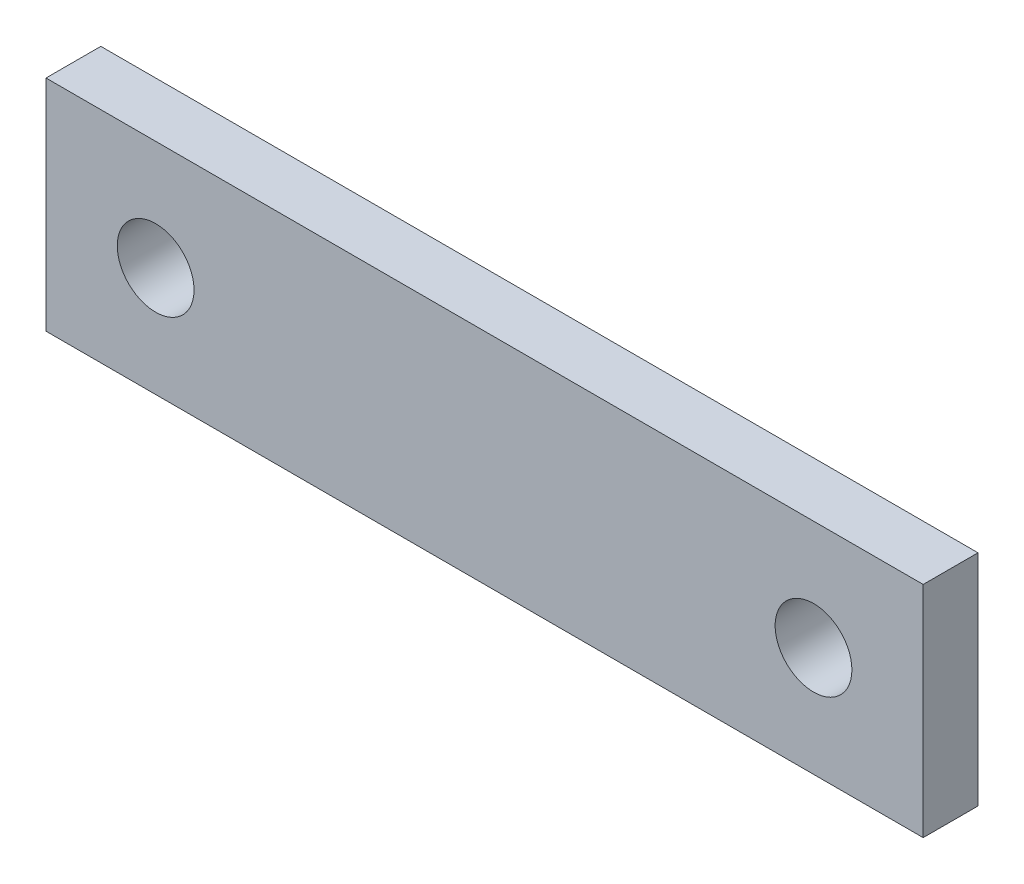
ISO-10303-21;
HEADER;
FILE_DESCRIPTION(('STEP AP214'),'2;1');
FILE_NAME('part.step','',(''),(''),'','','');
FILE_SCHEMA(('AUTOMOTIVE_DESIGN { 1 0 10303 214 1 1 1 1 }'));
ENDSEC;
DATA;
#1=APPLICATION_CONTEXT('core data for automotive mechanical design processes');
#2=APPLICATION_PROTOCOL_DEFINITION('international standard','automotive_design',2000,#1);
#3=PRODUCT_CONTEXT('',#1,'mechanical');
#4=PRODUCT('Part','Part','',(#3));
#5=PRODUCT_RELATED_PRODUCT_CATEGORY('part','',(#4));
#6=PRODUCT_DEFINITION_FORMATION('','',#4);
#7=PRODUCT_DEFINITION_CONTEXT('part definition',#1,'design');
#8=PRODUCT_DEFINITION('design','',#6,#7);
#9=PRODUCT_DEFINITION_SHAPE('','',#8);
#10=(LENGTH_UNIT() NAMED_UNIT(*) SI_UNIT(.MILLI.,.METRE.));
#11=(NAMED_UNIT(*) PLANE_ANGLE_UNIT() SI_UNIT($,.RADIAN.));
#12=(NAMED_UNIT(*) SI_UNIT($,.STERADIAN.) SOLID_ANGLE_UNIT());
#13=UNCERTAINTY_MEASURE_WITH_UNIT(LENGTH_MEASURE(1.E-05),#10,'distance_accuracy_value','');
#14=(GEOMETRIC_REPRESENTATION_CONTEXT(3) GLOBAL_UNCERTAINTY_ASSIGNED_CONTEXT((#13)) GLOBAL_UNIT_ASSIGNED_CONTEXT((#10,
#11,#12)) REPRESENTATION_CONTEXT('',''));
#15=CARTESIAN_POINT('',(0.,0.,0.));
#16=DIRECTION('',(0.,0.,1.));
#17=DIRECTION('',(1.,0.,0.));
#18=AXIS2_PLACEMENT_3D('',#15,#16,#17);
#19=CARTESIAN_POINT('',(80.,-20.,0.));
#20=DIRECTION('',(0.,0.,-1.));
#21=DIRECTION('',(0.,1.,0.));
#22=AXIS2_PLACEMENT_3D('',#19,#20,#21);
#23=PLANE('',#22);
#24=CARTESIAN_POINT('',(60.,0.,0.));
#25=DIRECTION('',(0.,0.,1.));
#26=DIRECTION('',(1.,0.,0.));
#27=AXIS2_PLACEMENT_3D('',#24,#25,#26);
#28=CIRCLE('',#27,6.99999999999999);
#29=CARTESIAN_POINT('',(67.,0.,0.));
#30=VERTEX_POINT('',#29);
#31=EDGE_CURVE('E129',#30,#30,#28,.T.);
#32=ORIENTED_EDGE('',*,*,#31,.F.);
#33=EDGE_LOOP('',(#32));
#34=FACE_BOUND('',#33,.T.);
#35=CARTESIAN_POINT('',(-60.,0.,0.));
#36=DIRECTION('',(0.,0.,1.));
#37=DIRECTION('',(1.,0.,0.));
#38=AXIS2_PLACEMENT_3D('',#35,#36,#37);
#39=CIRCLE('',#38,6.99999999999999);
#40=CARTESIAN_POINT('',(-53.,0.,0.));
#41=VERTEX_POINT('',#40);
#42=EDGE_CURVE('E92',#41,#41,#39,.T.);
#43=ORIENTED_EDGE('',*,*,#42,.F.);
#44=EDGE_LOOP('',(#43));
#45=FACE_BOUND('',#44,.T.);
#46=DIRECTION('',(0.,-1.,0.));
#47=VECTOR('',#46,1.);
#48=CARTESIAN_POINT('',(-80.,-20.,0.));
#49=LINE('',#48,#47);
#50=CARTESIAN_POINT('',(-80.,20.,0.));
#51=VERTEX_POINT('',#50);
#52=CARTESIAN_POINT('',(-80.,-20.,0.));
#53=VERTEX_POINT('',#52);
#54=EDGE_CURVE('E76',#51,#53,#49,.T.);
#55=ORIENTED_EDGE('',*,*,#54,.T.);
#56=DIRECTION('',(-1.,0.,0.));
#57=VECTOR('',#56,1.);
#58=CARTESIAN_POINT('',(80.,-20.,0.));
#59=LINE('',#58,#57);
#60=CARTESIAN_POINT('',(80.,-20.,0.));
#61=VERTEX_POINT('',#60);
#62=EDGE_CURVE('E11',#61,#53,#59,.T.);
#63=ORIENTED_EDGE('',*,*,#62,.F.);
#64=DIRECTION('',(0.,-1.,0.));
#65=VECTOR('',#64,1.);
#66=CARTESIAN_POINT('',(80.,-20.,0.));
#67=LINE('',#66,#65);
#68=CARTESIAN_POINT('',(80.,20.,0.));
#69=VERTEX_POINT('',#68);
#70=EDGE_CURVE('E99',#69,#61,#67,.T.);
#71=ORIENTED_EDGE('',*,*,#70,.F.);
#72=DIRECTION('',(-1.,0.,0.));
#73=VECTOR('',#72,1.);
#74=CARTESIAN_POINT('',(80.,20.,0.));
#75=LINE('',#74,#73);
#76=EDGE_CURVE('E88',#69,#51,#75,.T.);
#77=ORIENTED_EDGE('',*,*,#76,.T.);
#78=EDGE_LOOP('',(#55,#63,#71,#77));
#79=FACE_BOUND('',#78,.T.);
#80=ADVANCED_FACE('F32',(#34,#45,#79),#23,.F.);
#81=CARTESIAN_POINT('',(80.,-20.,0.));
#82=DIRECTION('',(0.,1.,0.));
#83=DIRECTION('',(0.,0.,1.));
#84=AXIS2_PLACEMENT_3D('',#81,#82,#83);
#85=PLANE('',#84);
#86=DIRECTION('',(0.,0.,-1.));
#87=VECTOR('',#86,1.);
#88=CARTESIAN_POINT('',(-80.,-20.,0.));
#89=LINE('',#88,#87);
#90=CARTESIAN_POINT('',(-80.,-20.,-10.));
#91=VERTEX_POINT('',#90);
#92=EDGE_CURVE('E72',#53,#91,#89,.T.);
#93=ORIENTED_EDGE('',*,*,#92,.T.);
#94=DIRECTION('',(-1.,0.,0.));
#95=VECTOR('',#94,1.);
#96=CARTESIAN_POINT('',(80.,-20.,-10.));
#97=LINE('',#96,#95);
#98=CARTESIAN_POINT('',(80.,-20.,-10.));
#99=VERTEX_POINT('',#98);
#100=EDGE_CURVE('E39',#99,#91,#97,.T.);
#101=ORIENTED_EDGE('',*,*,#100,.F.);
#102=DIRECTION('',(0.,0.,-1.));
#103=VECTOR('',#102,1.);
#104=CARTESIAN_POINT('',(80.,-20.,0.));
#105=LINE('',#104,#103);
#106=EDGE_CURVE('E84',#61,#99,#105,.T.);
#107=ORIENTED_EDGE('',*,*,#106,.F.);
#108=ORIENTED_EDGE('',*,*,#62,.T.);
#109=EDGE_LOOP('',(#93,#101,#107,#108));
#110=FACE_BOUND('',#109,.T.);
#111=ADVANCED_FACE('F83',(#110),#85,.F.);
#112=CARTESIAN_POINT('',(80.,-20.,-10.));
#113=DIRECTION('',(0.,0.,1.));
#114=DIRECTION('',(0.,-1.,0.));
#115=AXIS2_PLACEMENT_3D('',#112,#113,#114);
#116=PLANE('',#115);
#117=CARTESIAN_POINT('',(60.,0.,-10.));
#118=DIRECTION('',(0.,0.,1.));
#119=DIRECTION('',(0.,-1.,0.));
#120=AXIS2_PLACEMENT_3D('',#117,#118,#119);
#121=CIRCLE('',#120,6.99999999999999);
#122=CARTESIAN_POINT('',(60.,-6.99999999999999,-10.));
#123=VERTEX_POINT('',#122);
#124=EDGE_CURVE('E133',#123,#123,#121,.T.);
#125=ORIENTED_EDGE('',*,*,#124,.T.);
#126=EDGE_LOOP('',(#125));
#127=FACE_BOUND('',#126,.T.);
#128=CARTESIAN_POINT('',(-60.,0.,-10.));
#129=DIRECTION('',(0.,0.,1.));
#130=DIRECTION('',(0.,-1.,0.));
#131=AXIS2_PLACEMENT_3D('',#128,#129,#130);
#132=CIRCLE('',#131,6.99999999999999);
#133=CARTESIAN_POINT('',(-60.,-6.99999999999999,-10.));
#134=VERTEX_POINT('',#133);
#135=EDGE_CURVE('E89',#134,#134,#132,.T.);
#136=ORIENTED_EDGE('',*,*,#135,.T.);
#137=EDGE_LOOP('',(#136));
#138=FACE_BOUND('',#137,.T.);
#139=DIRECTION('',(0.,1.,0.));
#140=VECTOR('',#139,1.);
#141=CARTESIAN_POINT('',(-80.,-20.,-10.));
#142=LINE('',#141,#140);
#143=CARTESIAN_POINT('',(-80.,20.,-9.99999999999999));
#144=VERTEX_POINT('',#143);
#145=EDGE_CURVE('E77',#91,#144,#142,.T.);
#146=ORIENTED_EDGE('',*,*,#145,.T.);
#147=DIRECTION('',(-1.,0.,0.));
#148=VECTOR('',#147,1.);
#149=CARTESIAN_POINT('',(80.,20.,-9.99999999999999));
#150=LINE('',#149,#148);
#151=CARTESIAN_POINT('',(80.,20.,-9.99999999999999));
#152=VERTEX_POINT('',#151);
#153=EDGE_CURVE('E105',#152,#144,#150,.T.);
#154=ORIENTED_EDGE('',*,*,#153,.F.);
#155=DIRECTION('',(0.,1.,0.));
#156=VECTOR('',#155,1.);
#157=CARTESIAN_POINT('',(80.,-20.,-10.));
#158=LINE('',#157,#156);
#159=EDGE_CURVE('E51',#99,#152,#158,.T.);
#160=ORIENTED_EDGE('',*,*,#159,.F.);
#161=ORIENTED_EDGE('',*,*,#100,.T.);
#162=EDGE_LOOP('',(#146,#154,#160,#161));
#163=FACE_BOUND('',#162,.T.);
#164=ADVANCED_FACE('F108',(#127,#138,#163),#116,.F.);
#165=CARTESIAN_POINT('',(80.,20.,0.));
#166=DIRECTION('',(0.,-1.,0.));
#167=DIRECTION('',(0.,0.,-1.));
#168=AXIS2_PLACEMENT_3D('',#165,#166,#167);
#169=PLANE('',#168);
#170=DIRECTION('',(0.,0.,1.));
#171=VECTOR('',#170,1.);
#172=CARTESIAN_POINT('',(-80.,20.,0.));
#173=LINE('',#172,#171);
#174=EDGE_CURVE('E97',#144,#51,#173,.T.);
#175=ORIENTED_EDGE('',*,*,#174,.T.);
#176=ORIENTED_EDGE('',*,*,#76,.F.);
#177=DIRECTION('',(0.,0.,1.));
#178=VECTOR('',#177,1.);
#179=CARTESIAN_POINT('',(80.,20.,0.));
#180=LINE('',#179,#178);
#181=EDGE_CURVE('E46',#152,#69,#180,.T.);
#182=ORIENTED_EDGE('',*,*,#181,.F.);
#183=ORIENTED_EDGE('',*,*,#153,.T.);
#184=EDGE_LOOP('',(#175,#176,#182,#183));
#185=FACE_BOUND('',#184,.T.);
#186=ADVANCED_FACE('F110',(#185),#169,.F.);
#187=CARTESIAN_POINT('',(80.,20.,0.));
#188=DIRECTION('',(-1.,0.,0.));
#189=DIRECTION('',(0.,0.,1.));
#190=AXIS2_PLACEMENT_3D('',#187,#188,#189);
#191=PLANE('',#190);
#192=ORIENTED_EDGE('',*,*,#70,.T.);
#193=ORIENTED_EDGE('',*,*,#106,.T.);
#194=ORIENTED_EDGE('',*,*,#159,.T.);
#195=ORIENTED_EDGE('',*,*,#181,.T.);
#196=EDGE_LOOP('',(#192,#193,#194,#195));
#197=FACE_BOUND('',#196,.T.);
#198=ADVANCED_FACE('F111',(#197),#191,.F.);
#199=CARTESIAN_POINT('',(-80.,20.,0.));
#200=DIRECTION('',(-1.,0.,0.));
#201=DIRECTION('',(0.,0.,1.));
#202=AXIS2_PLACEMENT_3D('',#199,#200,#201);
#203=PLANE('',#202);
#204=ORIENTED_EDGE('',*,*,#54,.F.);
#205=ORIENTED_EDGE('',*,*,#174,.F.);
#206=ORIENTED_EDGE('',*,*,#145,.F.);
#207=ORIENTED_EDGE('',*,*,#92,.F.);
#208=EDGE_LOOP('',(#204,#205,#206,#207));
#209=FACE_BOUND('',#208,.T.);
#210=ADVANCED_FACE('F73',(#209),#203,.T.);
#211=CARTESIAN_POINT('',(-60.,0.,0.));
#212=DIRECTION('',(0.,0.,1.));
#213=DIRECTION('',(1.,0.,0.));
#214=AXIS2_PLACEMENT_3D('',#211,#212,#213);
#215=CYLINDRICAL_SURFACE('',#214,6.99999999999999);
#216=ORIENTED_EDGE('',*,*,#135,.F.);
#217=EDGE_LOOP('',(#216));
#218=FACE_BOUND('',#217,.T.);
#219=ORIENTED_EDGE('',*,*,#42,.T.);
#220=EDGE_LOOP('',(#219));
#221=FACE_BOUND('',#220,.T.);
#222=ADVANCED_FACE('F118',(#218,#221),#215,.F.);
#223=CARTESIAN_POINT('',(60.,0.,0.));
#224=DIRECTION('',(0.,0.,1.));
#225=DIRECTION('',(1.,0.,0.));
#226=AXIS2_PLACEMENT_3D('',#223,#224,#225);
#227=CYLINDRICAL_SURFACE('',#226,6.99999999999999);
#228=ORIENTED_EDGE('',*,*,#124,.F.);
#229=EDGE_LOOP('',(#228));
#230=FACE_BOUND('',#229,.T.);
#231=ORIENTED_EDGE('',*,*,#31,.T.);
#232=EDGE_LOOP('',(#231));
#233=FACE_BOUND('',#232,.T.);
#234=ADVANCED_FACE('F138',(#230,#233),#227,.F.);
#235=CLOSED_SHELL('',(#80,#111,#164,#186,#198,#210,#222,#234));
#236=MANIFOLD_SOLID_BREP('B2',#235);
#237=ADVANCED_BREP_SHAPE_REPRESENTATION('',(#18,#236),#14);
#238=SHAPE_DEFINITION_REPRESENTATION(#9,#237);
ENDSEC;
END-ISO-10303-21;
